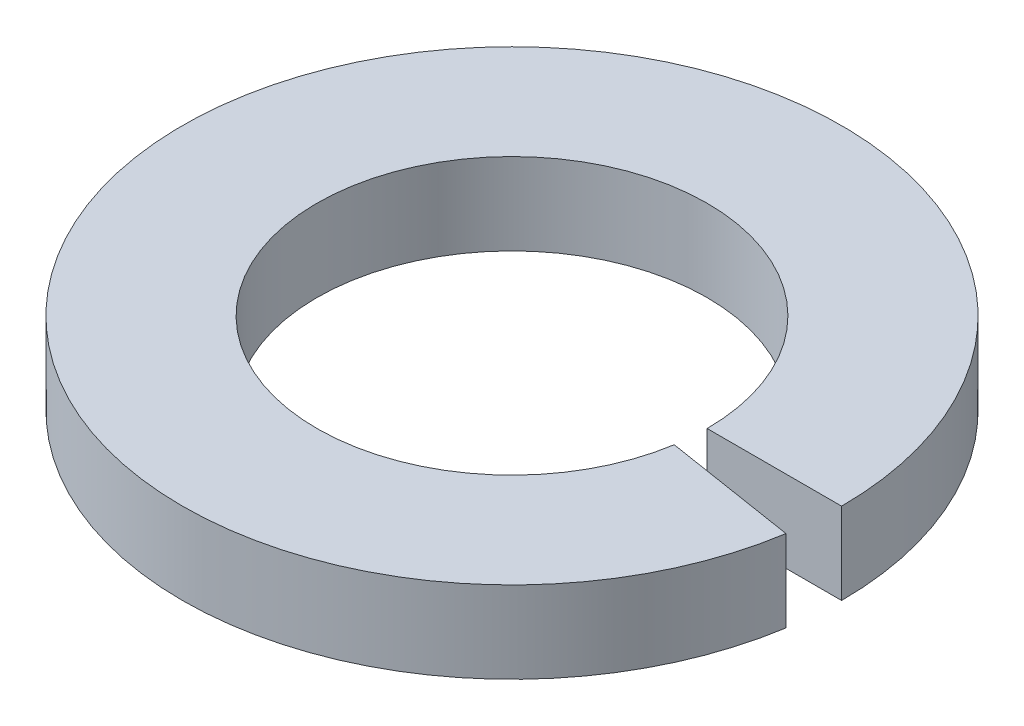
ISO-10303-21;
HEADER;
FILE_DESCRIPTION(('STEP AP214'),'2;1');
FILE_NAME('part.step','',(''),(''),'','','');
FILE_SCHEMA(('AUTOMOTIVE_DESIGN { 1 0 10303 214 1 1 1 1 }'));
ENDSEC;
DATA;
#1=APPLICATION_CONTEXT('core data for automotive mechanical design processes');
#2=APPLICATION_PROTOCOL_DEFINITION('international standard','automotive_design',2000,#1);
#3=PRODUCT_CONTEXT('',#1,'mechanical');
#4=PRODUCT('Part','Part','',(#3));
#5=PRODUCT_RELATED_PRODUCT_CATEGORY('part','',(#4));
#6=PRODUCT_DEFINITION_FORMATION('','',#4);
#7=PRODUCT_DEFINITION_CONTEXT('part definition',#1,'design');
#8=PRODUCT_DEFINITION('design','',#6,#7);
#9=PRODUCT_DEFINITION_SHAPE('','',#8);
#10=(LENGTH_UNIT() NAMED_UNIT(*) SI_UNIT(.MILLI.,.METRE.));
#11=(NAMED_UNIT(*) PLANE_ANGLE_UNIT() SI_UNIT($,.RADIAN.));
#12=(NAMED_UNIT(*) SI_UNIT($,.STERADIAN.) SOLID_ANGLE_UNIT());
#13=UNCERTAINTY_MEASURE_WITH_UNIT(LENGTH_MEASURE(1.E-05),#10,'distance_accuracy_value','');
#14=(GEOMETRIC_REPRESENTATION_CONTEXT(3) GLOBAL_UNCERTAINTY_ASSIGNED_CONTEXT((#13)) GLOBAL_UNIT_ASSIGNED_CONTEXT((#10,
#11,#12)) REPRESENTATION_CONTEXT('',''));
#15=CARTESIAN_POINT('',(0.,0.,0.));
#16=DIRECTION('',(0.,0.,1.));
#17=DIRECTION('',(1.,0.,0.));
#18=AXIS2_PLACEMENT_3D('',#15,#16,#17);
#19=CARTESIAN_POINT('',(3.13591048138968,-1.11022302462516E-12,0.49667942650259));
#20=DIRECTION('',(0.,-1.00000000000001,0.));
#21=DIRECTION('',(0.,0.,-1.));
#22=AXIS2_PLACEMENT_3D('',#19,#20,#21);
#23=PLANE('',#22);
#24=CARTESIAN_POINT('',(1.11022302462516E-13,4.21884749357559E-12,0.));
#25=DIRECTION('',(0.,-1.00000000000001,0.));
#26=DIRECTION('',(0.,0.,-1.));
#27=AXIS2_PLACEMENT_3D('',#24,#25,#26);
#28=CIRCLE('',#27,1.8796);
#29=CARTESIAN_POINT('',(1.85645900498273,-2.22044604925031E-13,0.294034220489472));
#30=VERTEX_POINT('',#29);
#31=CARTESIAN_POINT('',(1.87960000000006,-9.76996261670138E-12,-1.17961196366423E-13));
#32=VERTEX_POINT('',#31);
#33=EDGE_CURVE('E11',#30,#32,#28,.T.);
#34=ORIENTED_EDGE('',*,*,#33,.F.);
#35=DIRECTION('',(0.987688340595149,0.,0.15643446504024));
#36=VECTOR('',#35,1.);
#37=CARTESIAN_POINT('',(3.13591048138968,-1.11022302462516E-12,0.49667942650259));
#38=LINE('',#37,#36);
#39=CARTESIAN_POINT('',(3.13591048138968,-1.11022302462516E-12,0.49667942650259));
#40=VERTEX_POINT('',#39);
#41=EDGE_CURVE('E73',#30,#40,#38,.T.);
#42=ORIENTED_EDGE('',*,*,#41,.T.);
#43=CARTESIAN_POINT('',(1.11022302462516E-13,4.21884749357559E-12,0.));
#44=DIRECTION('',(0.,-1.00000000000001,0.));
#45=DIRECTION('',(0.,0.,-1.));
#46=AXIS2_PLACEMENT_3D('',#43,#44,#45);
#47=CIRCLE('',#46,3.175);
#48=CARTESIAN_POINT('',(3.17500000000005,-8.21565038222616E-12,0.));
#49=VERTEX_POINT('',#48);
#50=EDGE_CURVE('E68',#40,#49,#47,.T.);
#51=ORIENTED_EDGE('',*,*,#50,.T.);
#52=DIRECTION('',(1.00000000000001,0.,0.));
#53=VECTOR('',#52,1.);
#54=CARTESIAN_POINT('',(3.17500000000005,-8.21565038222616E-12,0.));
#55=LINE('',#54,#53);
#56=EDGE_CURVE('E71',#32,#49,#55,.T.);
#57=ORIENTED_EDGE('',*,*,#56,.F.);
#58=EDGE_LOOP('',(#34,#42,#51,#57));
#59=FACE_BOUND('',#58,.T.);
#60=ADVANCED_FACE('F32',(#59),#23,.T.);
#61=CARTESIAN_POINT('',(-1.15879528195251E-12,-39.3700000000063,-1.80411241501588E-13));
#62=DIRECTION('',(0.,-1.00000000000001,0.));
#63=DIRECTION('',(0.,0.,-1.));
#64=AXIS2_PLACEMENT_3D('',#61,#62,#63);
#65=CYLINDRICAL_SURFACE('',#64,1.8796);
#66=CARTESIAN_POINT('',(0.,0.787399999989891,-1.31838984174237E-13));
#67=DIRECTION('',(0.,-1.00000000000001,0.));
#68=DIRECTION('',(0.,0.,-1.));
#69=AXIS2_PLACEMENT_3D('',#66,#67,#68);
#70=CIRCLE('',#69,1.8796);
#71=CARTESIAN_POINT('',(1.8564590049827,0.787399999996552,0.294034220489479));
#72=VERTEX_POINT('',#71);
#73=CARTESIAN_POINT('',(1.87960000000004,0.787399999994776,-1.11022302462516E-13));
#74=VERTEX_POINT('',#73);
#75=EDGE_CURVE('E40',#72,#74,#70,.T.);
#76=ORIENTED_EDGE('',*,*,#75,.F.);
#77=DIRECTION('',(0.,-1.00000000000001,0.));
#78=VECTOR('',#77,1.);
#79=CARTESIAN_POINT('',(1.85645900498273,-2.22044604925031E-13,0.294034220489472));
#80=LINE('',#79,#78);
#81=EDGE_CURVE('E78',#72,#30,#80,.T.);
#82=ORIENTED_EDGE('',*,*,#81,.T.);
#83=ORIENTED_EDGE('',*,*,#33,.T.);
#84=DIRECTION('',(0.,-1.00000000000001,0.));
#85=VECTOR('',#84,1.);
#86=CARTESIAN_POINT('',(1.87960000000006,-9.76996261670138E-12,-1.17961196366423E-13));
#87=LINE('',#86,#85);
#88=EDGE_CURVE('E90',#74,#32,#87,.T.);
#89=ORIENTED_EDGE('',*,*,#88,.F.);
#90=EDGE_LOOP('',(#76,#82,#83,#89));
#91=FACE_BOUND('',#90,.T.);
#92=ADVANCED_FACE('F34',(#91),#65,.F.);
#93=CARTESIAN_POINT('',(1.8564590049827,0.787399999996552,0.294034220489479));
#94=DIRECTION('',(0.,1.00000000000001,0.));
#95=DIRECTION('',(0.,0.,1.));
#96=AXIS2_PLACEMENT_3D('',#93,#94,#95);
#97=PLANE('',#96);
#98=CARTESIAN_POINT('',(0.,0.787399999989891,-1.31838984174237E-13));
#99=DIRECTION('',(0.,-1.00000000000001,0.));
#100=DIRECTION('',(0.,0.,-1.));
#101=AXIS2_PLACEMENT_3D('',#98,#99,#100);
#102=CIRCLE('',#101,3.175);
#103=CARTESIAN_POINT('',(3.13591048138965,0.787400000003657,0.496679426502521));
#104=VERTEX_POINT('',#103);
#105=CARTESIAN_POINT('',(3.17500000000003,0.787400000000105,0.));
#106=VERTEX_POINT('',#105);
#107=EDGE_CURVE('E77',#104,#106,#102,.T.);
#108=ORIENTED_EDGE('',*,*,#107,.F.);
#109=DIRECTION('',(-0.987688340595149,0.,-0.15643446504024));
#110=VECTOR('',#109,1.);
#111=CARTESIAN_POINT('',(1.8564590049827,0.787399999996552,0.294034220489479));
#112=LINE('',#111,#110);
#113=EDGE_CURVE('E98',#104,#72,#112,.T.);
#114=ORIENTED_EDGE('',*,*,#113,.T.);
#115=ORIENTED_EDGE('',*,*,#75,.T.);
#116=DIRECTION('',(-1.00000000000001,0.,0.));
#117=VECTOR('',#116,1.);
#118=CARTESIAN_POINT('',(1.87960000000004,0.787399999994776,-1.11022302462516E-13));
#119=LINE('',#118,#117);
#120=EDGE_CURVE('E86',#106,#74,#119,.T.);
#121=ORIENTED_EDGE('',*,*,#120,.F.);
#122=EDGE_LOOP('',(#108,#114,#115,#121));
#123=FACE_BOUND('',#122,.T.);
#124=ADVANCED_FACE('F102',(#123),#97,.T.);
#125=CARTESIAN_POINT('',(-1.15879528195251E-12,-39.3700000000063,-1.80411241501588E-13));
#126=DIRECTION('',(0.,-1.00000000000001,0.));
#127=DIRECTION('',(0.,0.,-1.));
#128=AXIS2_PLACEMENT_3D('',#125,#126,#127);
#129=CYLINDRICAL_SURFACE('',#128,3.175);
#130=DIRECTION('',(0.,1.00000000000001,0.));
#131=VECTOR('',#130,1.);
#132=CARTESIAN_POINT('',(3.13591048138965,0.787400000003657,0.496679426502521));
#133=LINE('',#132,#131);
#134=EDGE_CURVE('E96',#40,#104,#133,.T.);
#135=ORIENTED_EDGE('',*,*,#134,.T.);
#136=ORIENTED_EDGE('',*,*,#107,.T.);
#137=DIRECTION('',(0.,1.00000000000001,0.));
#138=VECTOR('',#137,1.);
#139=CARTESIAN_POINT('',(3.17500000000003,0.787400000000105,0.));
#140=LINE('',#139,#138);
#141=EDGE_CURVE('E81',#49,#106,#140,.T.);
#142=ORIENTED_EDGE('',*,*,#141,.F.);
#143=ORIENTED_EDGE('',*,*,#50,.F.);
#144=EDGE_LOOP('',(#135,#136,#142,#143));
#145=FACE_BOUND('',#144,.T.);
#146=ADVANCED_FACE('F82',(#145),#129,.T.);
#147=CARTESIAN_POINT('',(1.85645900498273,-2.22044604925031E-13,0.294034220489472));
#148=DIRECTION('',(0.156434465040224,0.,-0.987688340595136));
#149=DIRECTION('',(-0.987688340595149,0.,-0.15643446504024));
#150=AXIS2_PLACEMENT_3D('',#147,#148,#149);
#151=PLANE('',#150);
#152=ORIENTED_EDGE('',*,*,#41,.F.);
#153=ORIENTED_EDGE('',*,*,#81,.F.);
#154=ORIENTED_EDGE('',*,*,#113,.F.);
#155=ORIENTED_EDGE('',*,*,#134,.F.);
#156=EDGE_LOOP('',(#152,#153,#154,#155));
#157=FACE_BOUND('',#156,.T.);
#158=ADVANCED_FACE('F106',(#157),#151,.T.);
#159=CARTESIAN_POINT('',(1.87960000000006,-9.76996261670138E-12,-1.17961196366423E-13));
#160=DIRECTION('',(0.,0.,-1.));
#161=DIRECTION('',(-1.00000000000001,0.,0.));
#162=AXIS2_PLACEMENT_3D('',#159,#160,#161);
#163=PLANE('',#162);
#164=ORIENTED_EDGE('',*,*,#56,.T.);
#165=ORIENTED_EDGE('',*,*,#141,.T.);
#166=ORIENTED_EDGE('',*,*,#120,.T.);
#167=ORIENTED_EDGE('',*,*,#88,.T.);
#168=EDGE_LOOP('',(#164,#165,#166,#167));
#169=FACE_BOUND('',#168,.T.);
#170=ADVANCED_FACE('F89',(#169),#163,.F.);
#171=CLOSED_SHELL('',(#60,#92,#124,#146,#158,#170));
#172=MANIFOLD_SOLID_BREP('B2',#171);
#173=ADVANCED_BREP_SHAPE_REPRESENTATION('',(#18,#172),#14);
#174=SHAPE_DEFINITION_REPRESENTATION(#9,#173);
ENDSEC;
END-ISO-10303-21;
